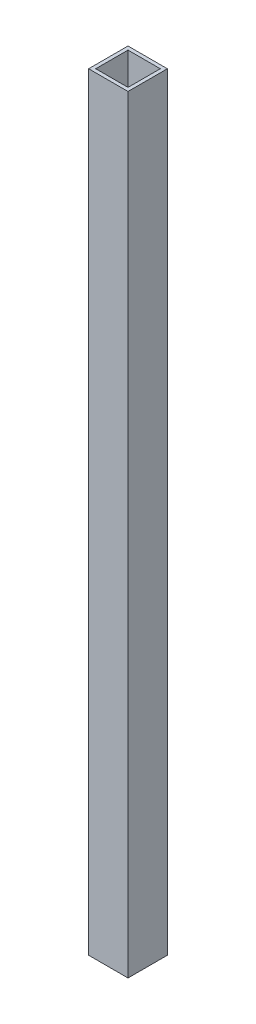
ISO-10303-21;
HEADER;
FILE_DESCRIPTION(('STEP AP214'),'2;1');
FILE_NAME('part.step','',(''),(''),'','','');
FILE_SCHEMA(('AUTOMOTIVE_DESIGN { 1 0 10303 214 1 1 1 1 }'));
ENDSEC;
DATA;
#1=APPLICATION_CONTEXT('core data for automotive mechanical design processes');
#2=APPLICATION_PROTOCOL_DEFINITION('international standard','automotive_design',2000,#1);
#3=PRODUCT_CONTEXT('',#1,'mechanical');
#4=PRODUCT('Part','Part','',(#3));
#5=PRODUCT_RELATED_PRODUCT_CATEGORY('part','',(#4));
#6=PRODUCT_DEFINITION_FORMATION('','',#4);
#7=PRODUCT_DEFINITION_CONTEXT('part definition',#1,'design');
#8=PRODUCT_DEFINITION('design','',#6,#7);
#9=PRODUCT_DEFINITION_SHAPE('','',#8);
#10=(LENGTH_UNIT() NAMED_UNIT(*) SI_UNIT(.MILLI.,.METRE.));
#11=(NAMED_UNIT(*) PLANE_ANGLE_UNIT() SI_UNIT($,.RADIAN.));
#12=(NAMED_UNIT(*) SI_UNIT($,.STERADIAN.) SOLID_ANGLE_UNIT());
#13=UNCERTAINTY_MEASURE_WITH_UNIT(LENGTH_MEASURE(1.E-05),#10,'distance_accuracy_value','');
#14=(GEOMETRIC_REPRESENTATION_CONTEXT(3) GLOBAL_UNCERTAINTY_ASSIGNED_CONTEXT((#13)) GLOBAL_UNIT_ASSIGNED_CONTEXT((#10,
#11,#12)) REPRESENTATION_CONTEXT('',''));
#15=CARTESIAN_POINT('',(0.,0.,0.));
#16=DIRECTION('',(0.,0.,1.));
#17=DIRECTION('',(1.,0.,0.));
#18=AXIS2_PLACEMENT_3D('',#15,#16,#17);
#19=CARTESIAN_POINT('',(0.,217.,0.));
#20=DIRECTION('',(0.,1.,0.));
#21=DIRECTION('',(0.,0.,1.));
#22=AXIS2_PLACEMENT_3D('',#19,#20,#21);
#23=PLANE('',#22);
#24=DIRECTION('',(0.,0.,-1.));
#25=VECTOR('',#24,1.);
#26=CARTESIAN_POINT('',(5.5645695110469,217.,-5.5645695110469));
#27=LINE('',#26,#25);
#28=CARTESIAN_POINT('',(5.5645695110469,217.,5.5645695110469));
#29=VERTEX_POINT('',#28);
#30=CARTESIAN_POINT('',(5.5645695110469,217.,-5.5645695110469));
#31=VERTEX_POINT('',#30);
#32=EDGE_CURVE('E133',#29,#31,#27,.T.);
#33=ORIENTED_EDGE('',*,*,#32,.T.);
#34=DIRECTION('',(-1.,0.,0.));
#35=VECTOR('',#34,1.);
#36=CARTESIAN_POINT('',(-5.5645695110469,217.,-5.5645695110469));
#37=LINE('',#36,#35);
#38=CARTESIAN_POINT('',(-5.5645695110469,217.,-5.5645695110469));
#39=VERTEX_POINT('',#38);
#40=EDGE_CURVE('E136',#31,#39,#37,.T.);
#41=ORIENTED_EDGE('',*,*,#40,.T.);
#42=DIRECTION('',(0.,0.,1.));
#43=VECTOR('',#42,1.);
#44=CARTESIAN_POINT('',(-5.5645695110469,217.,-5.5645695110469));
#45=LINE('',#44,#43);
#46=CARTESIAN_POINT('',(-5.5645695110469,217.,5.5645695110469));
#47=VERTEX_POINT('',#46);
#48=EDGE_CURVE('E139',#39,#47,#45,.T.);
#49=ORIENTED_EDGE('',*,*,#48,.T.);
#50=DIRECTION('',(1.,0.,0.));
#51=VECTOR('',#50,1.);
#52=CARTESIAN_POINT('',(-5.5645695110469,217.,5.5645695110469));
#53=LINE('',#52,#51);
#54=EDGE_CURVE('E141',#47,#29,#53,.T.);
#55=ORIENTED_EDGE('',*,*,#54,.T.);
#56=EDGE_LOOP('',(#33,#41,#49,#55));
#57=FACE_BOUND('',#56,.T.);
#58=DIRECTION('',(-1.,0.,0.));
#59=VECTOR('',#58,1.);
#60=CARTESIAN_POINT('',(-4.5645695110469,217.,-4.5645695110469));
#61=LINE('',#60,#59);
#62=CARTESIAN_POINT('',(4.5645695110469,217.,-4.5645695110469));
#63=VERTEX_POINT('',#62);
#64=CARTESIAN_POINT('',(-4.5645695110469,217.,-4.5645695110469));
#65=VERTEX_POINT('',#64);
#66=EDGE_CURVE('E105',#63,#65,#61,.T.);
#67=ORIENTED_EDGE('',*,*,#66,.F.);
#68=DIRECTION('',(0.,0.,-1.));
#69=VECTOR('',#68,1.);
#70=CARTESIAN_POINT('',(4.5645695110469,217.,4.5645695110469));
#71=LINE('',#70,#69);
#72=CARTESIAN_POINT('',(4.5645695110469,217.,4.5645695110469));
#73=VERTEX_POINT('',#72);
#74=EDGE_CURVE('E97',#73,#63,#71,.T.);
#75=ORIENTED_EDGE('',*,*,#74,.F.);
#76=DIRECTION('',(1.,0.,0.));
#77=VECTOR('',#76,1.);
#78=CARTESIAN_POINT('',(-4.5645695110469,217.,4.5645695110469));
#79=LINE('',#78,#77);
#80=CARTESIAN_POINT('',(-4.5645695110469,217.,4.5645695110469));
#81=VERTEX_POINT('',#80);
#82=EDGE_CURVE('E119',#81,#73,#79,.T.);
#83=ORIENTED_EDGE('',*,*,#82,.F.);
#84=DIRECTION('',(0.,0.,1.));
#85=VECTOR('',#84,1.);
#86=CARTESIAN_POINT('',(-4.5645695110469,217.,4.5645695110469));
#87=LINE('',#86,#85);
#88=EDGE_CURVE('E117',#65,#81,#87,.T.);
#89=ORIENTED_EDGE('',*,*,#88,.F.);
#90=EDGE_LOOP('',(#67,#75,#83,#89));
#91=FACE_BOUND('',#90,.T.);
#92=ADVANCED_FACE('F32',(#57,#91),#23,.T.);
#93=CARTESIAN_POINT('',(0.,0.,0.));
#94=DIRECTION('',(0.,1.,0.));
#95=DIRECTION('',(0.,0.,1.));
#96=AXIS2_PLACEMENT_3D('',#93,#94,#95);
#97=PLANE('',#96);
#98=DIRECTION('',(0.,0.,-1.));
#99=VECTOR('',#98,1.);
#100=CARTESIAN_POINT('',(5.5645695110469,0.,-5.5645695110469));
#101=LINE('',#100,#99);
#102=CARTESIAN_POINT('',(5.5645695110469,0.,5.5645695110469));
#103=VERTEX_POINT('',#102);
#104=CARTESIAN_POINT('',(5.5645695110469,0.,-5.5645695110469));
#105=VERTEX_POINT('',#104);
#106=EDGE_CURVE('E113',#103,#105,#101,.T.);
#107=ORIENTED_EDGE('',*,*,#106,.F.);
#108=DIRECTION('',(1.,0.,0.));
#109=VECTOR('',#108,1.);
#110=CARTESIAN_POINT('',(-5.5645695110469,0.,5.5645695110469));
#111=LINE('',#110,#109);
#112=CARTESIAN_POINT('',(-5.5645695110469,0.,5.5645695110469));
#113=VERTEX_POINT('',#112);
#114=EDGE_CURVE('E137',#113,#103,#111,.T.);
#115=ORIENTED_EDGE('',*,*,#114,.F.);
#116=DIRECTION('',(0.,0.,1.));
#117=VECTOR('',#116,1.);
#118=CARTESIAN_POINT('',(-5.5645695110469,0.,-5.5645695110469));
#119=LINE('',#118,#117);
#120=CARTESIAN_POINT('',(-5.5645695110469,0.,-5.5645695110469));
#121=VERTEX_POINT('',#120);
#122=EDGE_CURVE('E148',#121,#113,#119,.T.);
#123=ORIENTED_EDGE('',*,*,#122,.F.);
#124=DIRECTION('',(-1.,0.,0.));
#125=VECTOR('',#124,1.);
#126=CARTESIAN_POINT('',(-5.5645695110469,0.,-5.5645695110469));
#127=LINE('',#126,#125);
#128=EDGE_CURVE('E146',#105,#121,#127,.T.);
#129=ORIENTED_EDGE('',*,*,#128,.F.);
#130=EDGE_LOOP('',(#107,#115,#123,#129));
#131=FACE_BOUND('',#130,.T.);
#132=DIRECTION('',(0.,0.,-1.));
#133=VECTOR('',#132,1.);
#134=CARTESIAN_POINT('',(4.5645695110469,0.,4.5645695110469));
#135=LINE('',#134,#133);
#136=CARTESIAN_POINT('',(4.5645695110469,0.,4.5645695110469));
#137=VERTEX_POINT('',#136);
#138=CARTESIAN_POINT('',(4.5645695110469,0.,-4.5645695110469));
#139=VERTEX_POINT('',#138);
#140=EDGE_CURVE('E55',#137,#139,#135,.T.);
#141=ORIENTED_EDGE('',*,*,#140,.T.);
#142=DIRECTION('',(-1.,0.,0.));
#143=VECTOR('',#142,1.);
#144=CARTESIAN_POINT('',(-4.5645695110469,0.,-4.5645695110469));
#145=LINE('',#144,#143);
#146=CARTESIAN_POINT('',(-4.5645695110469,0.,-4.5645695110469));
#147=VERTEX_POINT('',#146);
#148=EDGE_CURVE('E112',#139,#147,#145,.T.);
#149=ORIENTED_EDGE('',*,*,#148,.T.);
#150=DIRECTION('',(0.,0.,1.));
#151=VECTOR('',#150,1.);
#152=CARTESIAN_POINT('',(-4.5645695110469,0.,4.5645695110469));
#153=LINE('',#152,#151);
#154=CARTESIAN_POINT('',(-4.5645695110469,0.,4.5645695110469));
#155=VERTEX_POINT('',#154);
#156=EDGE_CURVE('E125',#147,#155,#153,.T.);
#157=ORIENTED_EDGE('',*,*,#156,.T.);
#158=DIRECTION('',(1.,0.,0.));
#159=VECTOR('',#158,1.);
#160=CARTESIAN_POINT('',(-4.5645695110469,0.,4.5645695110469));
#161=LINE('',#160,#159);
#162=EDGE_CURVE('E106',#155,#137,#161,.T.);
#163=ORIENTED_EDGE('',*,*,#162,.T.);
#164=EDGE_LOOP('',(#141,#149,#157,#163));
#165=FACE_BOUND('',#164,.T.);
#166=ADVANCED_FACE('F166',(#131,#165),#97,.F.);
#167=CARTESIAN_POINT('',(5.5645695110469,217.,-5.5645695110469));
#168=DIRECTION('',(-1.,0.,0.));
#169=DIRECTION('',(0.,0.,1.));
#170=AXIS2_PLACEMENT_3D('',#167,#168,#169);
#171=PLANE('',#170);
#172=ORIENTED_EDGE('',*,*,#106,.T.);
#173=DIRECTION('',(0.,-1.,0.));
#174=VECTOR('',#173,1.);
#175=CARTESIAN_POINT('',(5.5645695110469,217.,-5.5645695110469));
#176=LINE('',#175,#174);
#177=EDGE_CURVE('E11',#31,#105,#176,.T.);
#178=ORIENTED_EDGE('',*,*,#177,.F.);
#179=ORIENTED_EDGE('',*,*,#32,.F.);
#180=DIRECTION('',(0.,-1.,0.));
#181=VECTOR('',#180,1.);
#182=CARTESIAN_POINT('',(5.5645695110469,217.,5.5645695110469));
#183=LINE('',#182,#181);
#184=EDGE_CURVE('E143',#29,#103,#183,.T.);
#185=ORIENTED_EDGE('',*,*,#184,.T.);
#186=EDGE_LOOP('',(#172,#178,#179,#185));
#187=FACE_BOUND('',#186,.T.);
#188=ADVANCED_FACE('F34',(#187),#171,.F.);
#189=CARTESIAN_POINT('',(-5.5645695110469,217.,-5.5645695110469));
#190=DIRECTION('',(0.,0.,1.));
#191=DIRECTION('',(1.,0.,0.));
#192=AXIS2_PLACEMENT_3D('',#189,#190,#191);
#193=PLANE('',#192);
#194=ORIENTED_EDGE('',*,*,#128,.T.);
#195=DIRECTION('',(0.,-1.,0.));
#196=VECTOR('',#195,1.);
#197=CARTESIAN_POINT('',(-5.5645695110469,217.,-5.5645695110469));
#198=LINE('',#197,#196);
#199=EDGE_CURVE('E40',#39,#121,#198,.T.);
#200=ORIENTED_EDGE('',*,*,#199,.F.);
#201=ORIENTED_EDGE('',*,*,#40,.F.);
#202=ORIENTED_EDGE('',*,*,#177,.T.);
#203=EDGE_LOOP('',(#194,#200,#201,#202));
#204=FACE_BOUND('',#203,.T.);
#205=ADVANCED_FACE('F176',(#204),#193,.F.);
#206=CARTESIAN_POINT('',(-5.5645695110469,217.,-5.5645695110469));
#207=DIRECTION('',(1.,0.,0.));
#208=DIRECTION('',(0.,0.,-1.));
#209=AXIS2_PLACEMENT_3D('',#206,#207,#208);
#210=PLANE('',#209);
#211=ORIENTED_EDGE('',*,*,#122,.T.);
#212=DIRECTION('',(0.,-1.,0.));
#213=VECTOR('',#212,1.);
#214=CARTESIAN_POINT('',(-5.5645695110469,217.,5.5645695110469));
#215=LINE('',#214,#213);
#216=EDGE_CURVE('E153',#47,#113,#215,.T.);
#217=ORIENTED_EDGE('',*,*,#216,.F.);
#218=ORIENTED_EDGE('',*,*,#48,.F.);
#219=ORIENTED_EDGE('',*,*,#199,.T.);
#220=EDGE_LOOP('',(#211,#217,#218,#219));
#221=FACE_BOUND('',#220,.T.);
#222=ADVANCED_FACE('F160',(#221),#210,.F.);
#223=CARTESIAN_POINT('',(-5.5645695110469,217.,5.5645695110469));
#224=DIRECTION('',(0.,0.,-1.));
#225=DIRECTION('',(-1.,0.,0.));
#226=AXIS2_PLACEMENT_3D('',#223,#224,#225);
#227=PLANE('',#226);
#228=ORIENTED_EDGE('',*,*,#114,.T.);
#229=ORIENTED_EDGE('',*,*,#184,.F.);
#230=ORIENTED_EDGE('',*,*,#54,.F.);
#231=ORIENTED_EDGE('',*,*,#216,.T.);
#232=EDGE_LOOP('',(#228,#229,#230,#231));
#233=FACE_BOUND('',#232,.T.);
#234=ADVANCED_FACE('F170',(#233),#227,.F.);
#235=CARTESIAN_POINT('',(4.5645695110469,217.,4.5645695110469));
#236=DIRECTION('',(-1.,0.,0.));
#237=DIRECTION('',(0.,0.,1.));
#238=AXIS2_PLACEMENT_3D('',#235,#236,#237);
#239=PLANE('',#238);
#240=ORIENTED_EDGE('',*,*,#140,.F.);
#241=DIRECTION('',(0.,-1.,0.));
#242=VECTOR('',#241,1.);
#243=CARTESIAN_POINT('',(4.5645695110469,217.,4.5645695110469));
#244=LINE('',#243,#242);
#245=EDGE_CURVE('E101',#73,#137,#244,.T.);
#246=ORIENTED_EDGE('',*,*,#245,.F.);
#247=ORIENTED_EDGE('',*,*,#74,.T.);
#248=DIRECTION('',(0.,-1.,0.));
#249=VECTOR('',#248,1.);
#250=CARTESIAN_POINT('',(4.5645695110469,217.,-4.5645695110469));
#251=LINE('',#250,#249);
#252=EDGE_CURVE('E100',#63,#139,#251,.T.);
#253=ORIENTED_EDGE('',*,*,#252,.T.);
#254=EDGE_LOOP('',(#240,#246,#247,#253));
#255=FACE_BOUND('',#254,.T.);
#256=ADVANCED_FACE('F99',(#255),#239,.T.);
#257=CARTESIAN_POINT('',(-4.5645695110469,217.,-4.5645695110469));
#258=DIRECTION('',(0.,0.,1.));
#259=DIRECTION('',(1.,0.,0.));
#260=AXIS2_PLACEMENT_3D('',#257,#258,#259);
#261=PLANE('',#260);
#262=ORIENTED_EDGE('',*,*,#148,.F.);
#263=ORIENTED_EDGE('',*,*,#252,.F.);
#264=ORIENTED_EDGE('',*,*,#66,.T.);
#265=DIRECTION('',(0.,-1.,0.));
#266=VECTOR('',#265,1.);
#267=CARTESIAN_POINT('',(-4.5645695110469,217.,-4.5645695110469));
#268=LINE('',#267,#266);
#269=EDGE_CURVE('E114',#65,#147,#268,.T.);
#270=ORIENTED_EDGE('',*,*,#269,.T.);
#271=EDGE_LOOP('',(#262,#263,#264,#270));
#272=FACE_BOUND('',#271,.T.);
#273=ADVANCED_FACE('F109',(#272),#261,.T.);
#274=CARTESIAN_POINT('',(-4.5645695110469,217.,4.5645695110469));
#275=DIRECTION('',(1.,0.,0.));
#276=DIRECTION('',(0.,0.,-1.));
#277=AXIS2_PLACEMENT_3D('',#274,#275,#276);
#278=PLANE('',#277);
#279=ORIENTED_EDGE('',*,*,#156,.F.);
#280=ORIENTED_EDGE('',*,*,#269,.F.);
#281=ORIENTED_EDGE('',*,*,#88,.T.);
#282=DIRECTION('',(0.,-1.,0.));
#283=VECTOR('',#282,1.);
#284=CARTESIAN_POINT('',(-4.5645695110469,217.,4.5645695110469));
#285=LINE('',#284,#283);
#286=EDGE_CURVE('E47',#81,#155,#285,.T.);
#287=ORIENTED_EDGE('',*,*,#286,.T.);
#288=EDGE_LOOP('',(#279,#280,#281,#287));
#289=FACE_BOUND('',#288,.T.);
#290=ADVANCED_FACE('F199',(#289),#278,.T.);
#291=CARTESIAN_POINT('',(-4.5645695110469,217.,4.5645695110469));
#292=DIRECTION('',(0.,0.,-1.));
#293=DIRECTION('',(-1.,0.,0.));
#294=AXIS2_PLACEMENT_3D('',#291,#292,#293);
#295=PLANE('',#294);
#296=ORIENTED_EDGE('',*,*,#162,.F.);
#297=ORIENTED_EDGE('',*,*,#286,.F.);
#298=ORIENTED_EDGE('',*,*,#82,.T.);
#299=ORIENTED_EDGE('',*,*,#245,.T.);
#300=EDGE_LOOP('',(#296,#297,#298,#299));
#301=FACE_BOUND('',#300,.T.);
#302=ADVANCED_FACE('F203',(#301),#295,.T.);
#303=CLOSED_SHELL('',(#92,#166,#188,#205,#222,#234,#256,#273,#290,#302));
#304=MANIFOLD_SOLID_BREP('B2',#303);
#305=ADVANCED_BREP_SHAPE_REPRESENTATION('',(#18,#304),#14);
#306=SHAPE_DEFINITION_REPRESENTATION(#9,#305);
ENDSEC;
END-ISO-10303-21;
